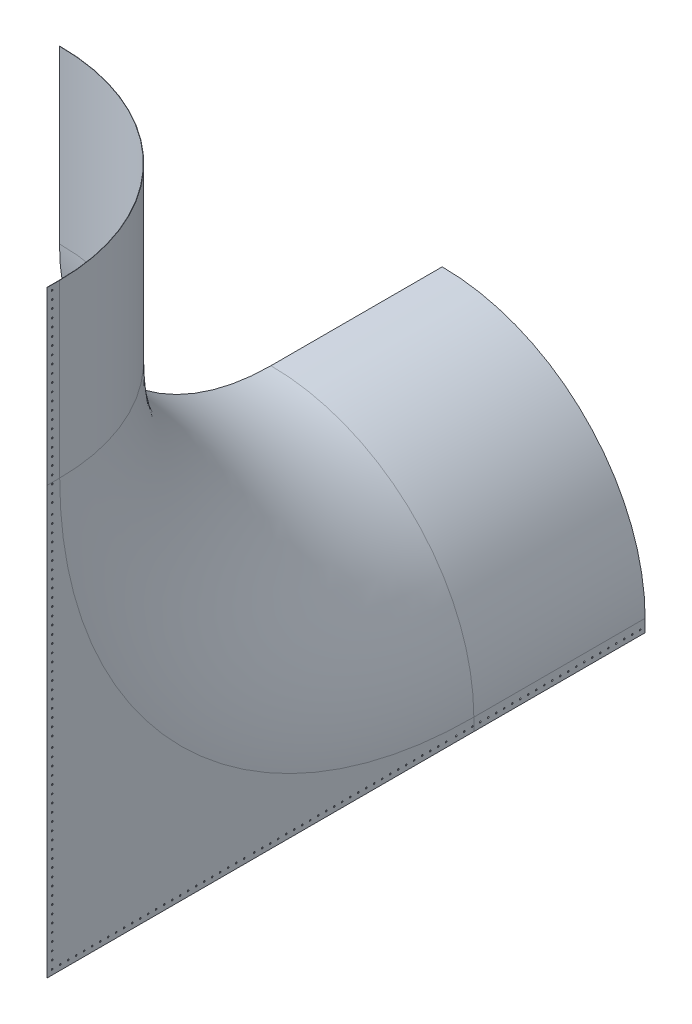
from build123d import *

# Parameters (mm, degrees)
BOSS_EXTRUDE1_DEPTH     = 1.5875
BOSS_EXTRUDE2_DEPTH     = 1007.1377971
BOSS_EXTRUDE3_START     = 1006.9599971
BOSS_EXTRUDE3_DEPTH     = 1006.9599971
SKETCH3_R               = 4.826
CUT_EXTRUDE1_DEPTH      = 10
CUT_EXTRUDE2_DEPTH      = 4621.606419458
CUT_EXTRUDE2_DEPTH_BACK = 4621.606419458
SKETCH5_W               = 4335.241922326
SKETCH5_H               = 3909.943943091
CUT_EXTRUDE3_DEPTH      = 88


with BuildPart() as part:
    # Sweep1: sweep along a path in Corner Arch
    with BuildLine(Plane.YZ) as sweep1_path:
        Line((0, 0), (0, 75.7422029))
        ThreePointArc((0, 75.7422029), (731.881575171, 1842.660627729), (2498.8, 2574.5422029))
        Line((2498.8, 2574.5422029), (2574.5422029, 2574.5422029))
    # sk 48.2in rad pnl → Sweep1 (sweep)
    with BuildSketch(Plane(origin=(0, 0, 0), x_dir=(0, 1, 0), z_dir=(0, 0, 1))):
        with BuildLine():
            Line((1222.6925, 0), (1222.6925, 75.746594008))
            Line((1222.6925, 75.746594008), (1224.28, 75.746594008))
            Line((1224.28, 75.746594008), (1224.28, 0))
            ThreePointArc((1224.28, 0), (865.696690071, -865.696690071), (0, -1224.28))
            Line((0, -1224.28), (-75.737811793, -1224.28))
            Line((-75.737811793, -1224.28), (-75.737811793, -1222.6925))
            Line((-75.737811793, -1222.6925), (0, -1222.6925))
            ThreePointArc((0, -1222.6925), (864.574158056, -864.574158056), (1222.6925, 0))
        make_face()
    sweep(path=sweep1_path.line)

    # Sketch1 → Boss-Extrude1 (add)
    with BuildSketch(Plane.YZ.offset(1224.28)):
        with BuildLine():
            Line((2498.8, 2650.280014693), (-75.737811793, 2650.280014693))
            Line((-75.737811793, 2650.280014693), (-75.737811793, 75.7422029))
            ThreePointArc((-75.737811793, 75.7422029), (678.32685486, 1896.21534804), (2498.8, 2650.280014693))
        make_face()
    extrude(amount=-BOSS_EXTRUDE1_DEPTH)

    # sk 48.2in rad pnl_2 → Boss-Extrude2 (add)
    with BuildSketch(Plane(origin=(0, 0, 0), x_dir=(0, 1, 0), z_dir=(0, 0, 1))):
        with BuildLine():
            Line((1222.6925, 0), (1222.6925, 75.746594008))
            Line((1222.6925, 75.746594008), (1224.28, 75.746594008))
            Line((1224.28, 75.746594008), (1224.28, 0))
            ThreePointArc((1224.28, 0), (865.696690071, -865.696690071), (0, -1224.28))
            Line((0, -1224.28), (-75.737811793, -1224.28))
            Line((-75.737811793, -1224.28), (-75.737811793, -1222.6925))
            Line((-75.737811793, -1222.6925), (0, -1222.6925))
            ThreePointArc((0, -1222.6925), (864.574158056, -864.574158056), (1222.6925, 0))
        make_face()
    extrude(amount=-BOSS_EXTRUDE2_DEPTH)

    # Sketch2 → Boss-Extrude3 (add)
    with BuildSketch(Plane(origin=(0, 2574.5422029, 0), x_dir=(-1, 0, 0), z_dir=(0, 1, 0)).offset(BOSS_EXTRUDE3_START)):
        with BuildLine():
            Line((-1224.28, 2650.280014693), (-1224.28, 2574.5422029))
            ThreePointArc((-1224.28, 2574.5422029), (-865.696690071, 1708.845512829), (0, 1350.2622029))
            Line((0, 1350.2622029), (75.746594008, 1350.2622029))
            Line((75.746594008, 1350.2622029), (75.746594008, 1351.8497029))
            Line((75.746594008, 1351.8497029), (0, 1351.8497029))
            ThreePointArc((0, 1351.8497029), (-864.574158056, 1709.968044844), (-1222.6925, 2574.5422029))
            Line((-1222.6925, 2574.5422029), (-1222.6925, 2650.280014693))
            Line((-1222.6925, 2650.280014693), (-1224.28, 2650.280014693))
        make_face()
    extrude(amount=-BOSS_EXTRUDE3_DEPTH)

    # Sketch3 → Cut-Extrude1 (cut)
    with BuildSketch(Plane.YZ.offset(1224.28)):
        with Locations(Location((-45.435611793, 2619.977814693, 0), (0, 0, 270))):
            Circle(SKETCH3_R)
        with Locations(Location((2.824388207, 2619.977814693, 0), (0, 0, 270))):
            Circle(SKETCH3_R)
        with Locations(Location((51.084388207, 2619.977814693, 0), (0, 0, 270))):
            Circle(SKETCH3_R)
        with Locations(Location((99.344388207, 2619.977814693, 0), (0, 0, 270))):
            Circle(SKETCH3_R)
        with Locations(Location((147.604388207, 2619.977814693, 0), (0, 0, 270))):
            Circle(SKETCH3_R)
        with Locations(Location((195.864388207, 2619.977814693, 0), (0, 0, 270))):
            Circle(SKETCH3_R)
        with Locations(Location((244.124388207, 2619.977814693, 0), (0, 0, 270))):
            Circle(SKETCH3_R)
        with Locations(Location((292.384388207, 2619.977814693, 0), (0, 0, 270))):
            Circle(SKETCH3_R)
        with Locations(Location((340.644388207, 2619.977814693, 0), (0, 0, 270))):
            Circle(SKETCH3_R)
        with Locations(Location((388.904388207, 2619.977814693, 0), (0, 0, 270))):
            Circle(SKETCH3_R)
        with Locations(Location((437.164388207, 2619.977814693, 0), (0, 0, 270))):
            Circle(SKETCH3_R)
        with Locations(Location((485.424388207, 2619.977814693, 0), (0, 0, 270))):
            Circle(SKETCH3_R)
        with Locations(Location((533.684388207, 2619.977814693, 0), (0, 0, 270))):
            Circle(SKETCH3_R)
        with Locations(Location((581.944388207, 2619.977814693, 0), (0, 0, 270))):
            Circle(SKETCH3_R)
        with Locations(Location((630.204388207, 2619.977814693, 0), (0, 0, 270))):
            Circle(SKETCH3_R)
        with Locations(Location((678.464388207, 2619.977814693, 0), (0, 0, 270))):
            Circle(SKETCH3_R)
        with Locations(Location((726.724388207, 2619.977814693, 0), (0, 0, 270))):
            Circle(SKETCH3_R)
        with Locations(Location((774.984388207, 2619.977814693, 0), (0, 0, 270))):
            Circle(SKETCH3_R)
        with Locations(Location((823.244388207, 2619.977814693, 0), (0, 0, 270))):
            Circle(SKETCH3_R)
        with Locations(Location((871.504388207, 2619.977814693, 0), (0, 0, 270))):
            Circle(SKETCH3_R)
        with Locations(Location((919.764388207, 2619.977814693, 0), (0, 0, 270))):
            Circle(SKETCH3_R)
        with Locations(Location((968.024388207, 2619.977814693, 0), (0, 0, 270))):
            Circle(SKETCH3_R)
        with Locations(Location((1016.284388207, 2619.977814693, 0), (0, 0, 270))):
            Circle(SKETCH3_R)
        with Locations(Location((1064.544388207, 2619.977814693, 0), (0, 0, 270))):
            Circle(SKETCH3_R)
        with Locations(Location((1112.804388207, 2619.977814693, 0), (0, 0, 270))):
            Circle(SKETCH3_R)
        with Locations(Location((-45.435611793, 2571.717814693, 0), (0, 0, 270))):
            Circle(SKETCH3_R)
        with Locations(Location((-45.435611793, 2523.457814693, 0), (0, 0, 270))):
            Circle(SKETCH3_R)
        with Locations(Location((-45.435611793, 2475.197814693, 0), (0, 0, 270))):
            Circle(SKETCH3_R)
        with Locations(Location((-45.435611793, 2426.937814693, 0), (0, 0, 270))):
            Circle(SKETCH3_R)
        with Locations(Location((-45.435611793, 2378.677814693, 0), (0, 0, 270))):
            Circle(SKETCH3_R)
        with Locations(Location((-45.435611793, 2330.417814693, 0), (0, 0, 270))):
            Circle(SKETCH3_R)
        with Locations(Location((-45.435611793, 2282.157814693, 0), (0, 0, 270))):
            Circle(SKETCH3_R)
        with Locations(Location((-45.435611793, 2233.897814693, 0), (0, 0, 270))):
            Circle(SKETCH3_R)
        with Locations(Location((-45.435611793, 2185.637814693, 0), (0, 0, 270))):
            Circle(SKETCH3_R)
        with Locations(Location((-45.435611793, 2137.377814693, 0), (0, 0, 270))):
            Circle(SKETCH3_R)
        with Locations(Location((-45.435611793, 2089.117814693, 0), (0, 0, 270))):
            Circle(SKETCH3_R)
        with Locations(Location((-45.435611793, 2040.857814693, 0), (0, 0, 270))):
            Circle(SKETCH3_R)
        with Locations(Location((-45.435611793, 1992.597814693, 0), (0, 0, 270))):
            Circle(SKETCH3_R)
        with Locations(Location((-45.435611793, 1944.337814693, 0), (0, 0, 270))):
            Circle(SKETCH3_R)
        with Locations(Location((-45.435611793, 1896.077814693, 0), (0, 0, 270))):
            Circle(SKETCH3_R)
        with Locations(Location((-45.435611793, 1847.817814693, 0), (0, 0, 270))):
            Circle(SKETCH3_R)
        with Locations(Location((-45.435611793, 1799.557814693, 0), (0, 0, 270))):
            Circle(SKETCH3_R)
        with Locations(Location((-45.435611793, 1751.297814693, 0), (0, 0, 270))):
            Circle(SKETCH3_R)
        with Locations(Location((-45.435611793, 1703.037814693, 0), (0, 0, 270))):
            Circle(SKETCH3_R)
        with Locations(Location((-45.435611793, 1654.777814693, 0), (0, 0, 270))):
            Circle(SKETCH3_R)
        with Locations(Location((-45.435611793, 1606.517814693, 0), (0, 0, 270))):
            Circle(SKETCH3_R)
        with Locations(Location((-45.435611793, 1558.257814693, 0), (0, 0, 270))):
            Circle(SKETCH3_R)
        with Locations(Location((-45.435611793, 1509.997814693, 0), (0, 0, 270))):
            Circle(SKETCH3_R)
        with Locations(Location((-45.435611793, 1461.737814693, 0), (0, 0, 270))):
            Circle(SKETCH3_R)
        with Locations(Location((-45.435611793, 1400.777814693, 0), (0, 0, 270))):
            Circle(SKETCH3_R)
        with Locations(Location((-45.435611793, 1352.517814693, 0), (0, 0, 270))):
            Circle(SKETCH3_R)
        with Locations(Location((-45.435611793, 1304.257814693, 0), (0, 0, 270))):
            Circle(SKETCH3_R)
        with Locations(Location((-45.435611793, 1255.997814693, 0), (0, 0, 270))):
            Circle(SKETCH3_R)
        with Locations(Location((-45.435611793, 1207.737814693, 0), (0, 0, 270))):
            Circle(SKETCH3_R)
        with Locations(Location((-45.435611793, 1159.477814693, 0), (0, 0, 270))):
            Circle(SKETCH3_R)
        with Locations(Location((-45.435611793, 1111.217814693, 0), (0, 0, 270))):
            Circle(SKETCH3_R)
        with Locations(Location((-45.435611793, 1062.957814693, 0), (0, 0, 270))):
            Circle(SKETCH3_R)
        with Locations(Location((-45.435611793, 1014.697814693, 0), (0, 0, 270))):
            Circle(SKETCH3_R)
        with Locations(Location((-45.435611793, 966.437814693, 0), (0, 0, 270))):
            Circle(SKETCH3_R)
        with Locations(Location((-45.435611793, 918.177814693, 0), (0, 0, 270))):
            Circle(SKETCH3_R)
        with Locations(Location((-45.435611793, 869.917814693, 0), (0, 0, 270))):
            Circle(SKETCH3_R)
        with Locations(Location((-45.435611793, 821.657814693, 0), (0, 0, 270))):
            Circle(SKETCH3_R)
        with Locations(Location((-45.435611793, 773.397814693, 0), (0, 0, 270))):
            Circle(SKETCH3_R)
        with Locations(Location((-45.435611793, 725.137814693, 0), (0, 0, 270))):
            Circle(SKETCH3_R)
        with Locations(Location((-45.435611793, 676.877814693, 0), (0, 0, 270))):
            Circle(SKETCH3_R)
        with Locations(Location((-45.435611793, 628.617814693, 0), (0, 0, 270))):
            Circle(SKETCH3_R)
        with Locations(Location((-45.435611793, 580.357814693, 0), (0, 0, 270))):
            Circle(SKETCH3_R)
        with Locations(Location((-45.435611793, 532.097814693, 0), (0, 0, 270))):
            Circle(SKETCH3_R)
        with Locations(Location((-45.435611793, 483.837814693, 0), (0, 0, 270))):
            Circle(SKETCH3_R)
        with Locations(Location((-45.435611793, 435.577814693, 0), (0, 0, 270))):
            Circle(SKETCH3_R)
        with Locations(Location((-45.435611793, 387.317814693, 0), (0, 0, 270))):
            Circle(SKETCH3_R)
        with Locations(Location((-45.435611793, 339.057814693, 0), (0, 0, 270))):
            Circle(SKETCH3_R)
        with Locations(Location((-45.435611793, 290.797814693, 0), (0, 0, 270))):
            Circle(SKETCH3_R)
        with Locations(Location((-45.435611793, 242.537814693, 0), (0, 0, 270))):
            Circle(SKETCH3_R)
        with Locations(Location((-45.435611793, 181.577814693, 0), (0, 0, 270))):
            Circle(SKETCH3_R)
        with Locations(Location((-45.435611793, 133.317814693, 0), (0, 0, 270))):
            Circle(SKETCH3_R)
        with Locations(Location((-45.435611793, 85.057814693, 0), (0, 0, 270))):
            Circle(SKETCH3_R)
        with Locations(Location((-45.435611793, 36.797814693, 0), (0, 0, 270))):
            Circle(SKETCH3_R)
        with Locations(Location((-45.435611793, -11.462185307, 0), (0, 0, 270))):
            Circle(SKETCH3_R)
        with Locations(Location((-45.435611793, -59.722185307, 0), (0, 0, 270))):
            Circle(SKETCH3_R)
        with Locations(Location((-45.435611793, -107.982185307, 0), (0, 0, 270))):
            Circle(SKETCH3_R)
        with Locations(Location((-45.435611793, -156.242185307, 0), (0, 0, 270))):
            Circle(SKETCH3_R)
        with Locations(Location((-45.435611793, -204.502185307, 0), (0, 0, 270))):
            Circle(SKETCH3_R)
        with Locations(Location((-45.435611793, -252.762185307, 0), (0, 0, 270))):
            Circle(SKETCH3_R)
        with Locations(Location((-45.435611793, -301.022185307, 0), (0, 0, 270))):
            Circle(SKETCH3_R)
        with Locations(Location((-45.435611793, -349.282185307, 0), (0, 0, 270))):
            Circle(SKETCH3_R)
        with Locations(Location((-45.435611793, -397.542185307, 0), (0, 0, 270))):
            Circle(SKETCH3_R)
        with Locations(Location((-45.435611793, -445.802185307, 0), (0, 0, 270))):
            Circle(SKETCH3_R)
        with Locations(Location((-45.435611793, -494.062185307, 0), (0, 0, 270))):
            Circle(SKETCH3_R)
        with Locations(Location((-45.435611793, -542.322185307, 0), (0, 0, 270))):
            Circle(SKETCH3_R)
        with Locations(Location((-45.435611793, -590.582185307, 0), (0, 0, 270))):
            Circle(SKETCH3_R)
        with Locations(Location((-45.435611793, -638.842185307, 0), (0, 0, 270))):
            Circle(SKETCH3_R)
        with Locations(Location((-45.435611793, -687.102185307, 0), (0, 0, 270))):
            Circle(SKETCH3_R)
        with Locations(Location((-45.435611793, -735.362185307, 0), (0, 0, 270))):
            Circle(SKETCH3_R)
        with Locations(Location((-45.435611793, -783.622185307, 0), (0, 0, 270))):
            Circle(SKETCH3_R)
        with Locations(Location((-45.435611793, -831.882185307, 0), (0, 0, 270))):
            Circle(SKETCH3_R)
        with Locations(Location((-45.435611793, -880.142185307, 0), (0, 0, 270))):
            Circle(SKETCH3_R)
        with Locations(Location((-45.435611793, -928.402185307, 0), (0, 0, 270))):
            Circle(SKETCH3_R)
        with Locations(Location((-45.435611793, -976.662185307, 0), (0, 0, 270))):
            Circle(SKETCH3_R)
        with Locations(Location((1173.764388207, 2619.977814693, 0), (0, 0, 270))):
            Circle(SKETCH3_R)
        with Locations(Location((1222.024388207, 2619.977814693, 0), (0, 0, 270))):
            Circle(SKETCH3_R)
        with Locations(Location((1270.284388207, 2619.977814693, 0), (0, 0, 270))):
            Circle(SKETCH3_R)
        with Locations(Location((1318.544388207, 2619.977814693, 0), (0, 0, 270))):
            Circle(SKETCH3_R)
        with Locations(Location((1366.804388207, 2619.977814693, 0), (0, 0, 270))):
            Circle(SKETCH3_R)
        with Locations(Location((1415.064388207, 2619.977814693, 0), (0, 0, 270))):
            Circle(SKETCH3_R)
        with Locations(Location((1463.324388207, 2619.977814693, 0), (0, 0, 270))):
            Circle(SKETCH3_R)
        with Locations(Location((1511.584388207, 2619.977814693, 0), (0, 0, 270))):
            Circle(SKETCH3_R)
        with Locations(Location((1559.844388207, 2619.977814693, 0), (0, 0, 270))):
            Circle(SKETCH3_R)
        with Locations(Location((1608.104388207, 2619.977814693, 0), (0, 0, 270))):
            Circle(SKETCH3_R)
        with Locations(Location((1656.364388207, 2619.977814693, 0), (0, 0, 270))):
            Circle(SKETCH3_R)
        with Locations(Location((1704.624388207, 2619.977814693, 0), (0, 0, 270))):
            Circle(SKETCH3_R)
        with Locations(Location((1752.884388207, 2619.977814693, 0), (0, 0, 270))):
            Circle(SKETCH3_R)
        with Locations(Location((1801.144388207, 2619.977814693, 0), (0, 0, 270))):
            Circle(SKETCH3_R)
        with Locations(Location((1849.404388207, 2619.977814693, 0), (0, 0, 270))):
            Circle(SKETCH3_R)
        with Locations(Location((1897.664388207, 2619.977814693, 0), (0, 0, 270))):
            Circle(SKETCH3_R)
        with Locations(Location((1945.924388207, 2619.977814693, 0), (0, 0, 270))):
            Circle(SKETCH3_R)
        with Locations(Location((1994.184388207, 2619.977814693, 0), (0, 0, 270))):
            Circle(SKETCH3_R)
        with Locations(Location((2042.444388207, 2619.977814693, 0), (0, 0, 270))):
            Circle(SKETCH3_R)
        with Locations(Location((2090.704388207, 2619.977814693, 0), (0, 0, 270))):
            Circle(SKETCH3_R)
        with Locations(Location((2138.964388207, 2619.977814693, 0), (0, 0, 270))):
            Circle(SKETCH3_R)
        with Locations(Location((2187.224388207, 2619.977814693, 0), (0, 0, 270))):
            Circle(SKETCH3_R)
        with Locations(Location((2235.484388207, 2619.977814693, 0), (0, 0, 270))):
            Circle(SKETCH3_R)
        with Locations(Location((2283.744388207, 2619.977814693, 0), (0, 0, 270))):
            Circle(SKETCH3_R)
        with Locations(Location((2332.004388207, 2619.977814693, 0), (0, 0, 270))):
            Circle(SKETCH3_R)
        with Locations(Location((2392.964388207, 2619.977814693, 0), (0, 0, 270))):
            Circle(SKETCH3_R)
        with Locations(Location((2441.224388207, 2619.977814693, 0), (0, 0, 270))):
            Circle(SKETCH3_R)
        with Locations(Location((2489.484388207, 2619.977814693, 0), (0, 0, 270))):
            Circle(SKETCH3_R)
        with Locations(Location((2537.744388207, 2619.977814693, 0), (0, 0, 270))):
            Circle(SKETCH3_R)
        with Locations(Location((2586.004388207, 2619.977814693, 0), (0, 0, 270))):
            Circle(SKETCH3_R)
        with Locations(Location((2634.264388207, 2619.977814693, 0), (0, 0, 270))):
            Circle(SKETCH3_R)
        with Locations(Location((2682.524388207, 2619.977814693, 0), (0, 0, 270))):
            Circle(SKETCH3_R)
        with Locations(Location((2730.784388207, 2619.977814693, 0), (0, 0, 270))):
            Circle(SKETCH3_R)
        with Locations(Location((2779.044388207, 2619.977814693, 0), (0, 0, 270))):
            Circle(SKETCH3_R)
        with Locations(Location((2827.304388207, 2619.977814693, 0), (0, 0, 270))):
            Circle(SKETCH3_R)
        with Locations(Location((2875.564388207, 2619.977814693, 0), (0, 0, 270))):
            Circle(SKETCH3_R)
        with Locations(Location((2923.824388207, 2619.977814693, 0), (0, 0, 270))):
            Circle(SKETCH3_R)
        with Locations(Location((2972.084388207, 2619.977814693, 0), (0, 0, 270))):
            Circle(SKETCH3_R)
        with Locations(Location((3020.344388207, 2619.977814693, 0), (0, 0, 270))):
            Circle(SKETCH3_R)
        with Locations(Location((3068.604388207, 2619.977814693, 0), (0, 0, 270))):
            Circle(SKETCH3_R)
        with Locations(Location((3116.864388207, 2619.977814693, 0), (0, 0, 270))):
            Circle(SKETCH3_R)
        with Locations(Location((3165.124388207, 2619.977814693, 0), (0, 0, 270))):
            Circle(SKETCH3_R)
        with Locations(Location((3213.384388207, 2619.977814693, 0), (0, 0, 270))):
            Circle(SKETCH3_R)
        with Locations(Location((3261.644388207, 2619.977814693, 0), (0, 0, 270))):
            Circle(SKETCH3_R)
        with Locations(Location((3309.904388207, 2619.977814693, 0), (0, 0, 270))):
            Circle(SKETCH3_R)
        with Locations(Location((3358.164388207, 2619.977814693, 0), (0, 0, 270))):
            Circle(SKETCH3_R)
        with Locations(Location((3406.424388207, 2619.977814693, 0), (0, 0, 270))):
            Circle(SKETCH3_R)
        with Locations(Location((3454.684388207, 2619.977814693, 0), (0, 0, 270))):
            Circle(SKETCH3_R)
        with Locations(Location((3502.944388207, 2619.977814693, 0), (0, 0, 270))):
            Circle(SKETCH3_R)
        with Locations(Location((3551.204388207, 2619.977814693, 0), (0, 0, 270))):
            Circle(SKETCH3_R)
    extrude(amount=-CUT_EXTRUDE1_DEPTH, mode=Mode.SUBTRACT)

    # Sketch4 → Cut-Extrude2 (cut, two sides: drawn at the far end of the back side and taken through both)
    with BuildSketch(Plane.YZ.offset(-CUT_EXTRUDE2_DEPTH_BACK)):
        Polygon((3532.15, 2838.149337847), (3807.151262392, 2838.149337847), (3807.151262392, -1062.099116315), (-165.760293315, -1062.099116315), (-165.760293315, -957.7855971), (3532.15, -957.7855971), align=None)
    extrude(amount=CUT_EXTRUDE2_DEPTH + CUT_EXTRUDE2_DEPTH_BACK, mode=Mode.SUBTRACT)

    # Sketch5 → Cut-Extrude3 (cut)
    with BuildSketch(Plane.YZ):
        with Locations((1671.350462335, 892.441056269)):
            Rectangle(SKETCH5_W, SKETCH5_H)
    extrude(amount=-CUT_EXTRUDE3_DEPTH, mode=Mode.SUBTRACT)


solid = part.part
